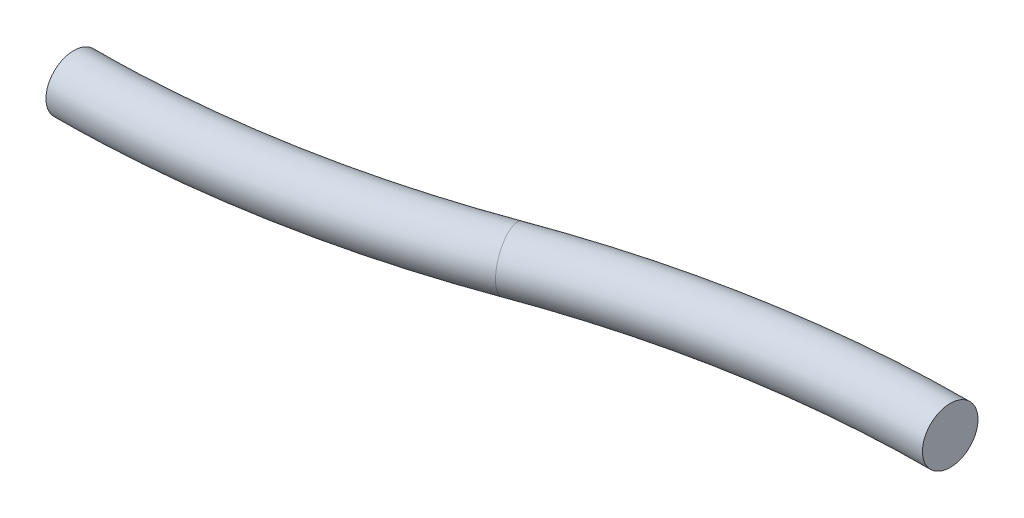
ISO-10303-21;
HEADER;
FILE_DESCRIPTION(('STEP AP214'),'2;1');
FILE_NAME('part.step','',(''),(''),'','','');
FILE_SCHEMA(('AUTOMOTIVE_DESIGN { 1 0 10303 214 1 1 1 1 }'));
ENDSEC;
DATA;
#1=APPLICATION_CONTEXT('core data for automotive mechanical design processes');
#2=APPLICATION_PROTOCOL_DEFINITION('international standard','automotive_design',2000,#1);
#3=PRODUCT_CONTEXT('',#1,'mechanical');
#4=PRODUCT('Part','Part','',(#3));
#5=PRODUCT_RELATED_PRODUCT_CATEGORY('part','',(#4));
#6=PRODUCT_DEFINITION_FORMATION('','',#4);
#7=PRODUCT_DEFINITION_CONTEXT('part definition',#1,'design');
#8=PRODUCT_DEFINITION('design','',#6,#7);
#9=PRODUCT_DEFINITION_SHAPE('','',#8);
#10=(LENGTH_UNIT() NAMED_UNIT(*) SI_UNIT(.MILLI.,.METRE.));
#11=(NAMED_UNIT(*) PLANE_ANGLE_UNIT() SI_UNIT($,.RADIAN.));
#12=(NAMED_UNIT(*) SI_UNIT($,.STERADIAN.) SOLID_ANGLE_UNIT());
#13=UNCERTAINTY_MEASURE_WITH_UNIT(LENGTH_MEASURE(1.E-05),#10,'distance_accuracy_value','');
#14=(GEOMETRIC_REPRESENTATION_CONTEXT(3) GLOBAL_UNCERTAINTY_ASSIGNED_CONTEXT((#13)) GLOBAL_UNIT_ASSIGNED_CONTEXT((#10,
#11,#12)) REPRESENTATION_CONTEXT('',''));
#15=CARTESIAN_POINT('',(0.,0.,0.));
#16=DIRECTION('',(0.,0.,1.));
#17=DIRECTION('',(1.,0.,0.));
#18=AXIS2_PLACEMENT_3D('',#15,#16,#17);
#19=CARTESIAN_POINT('',(127.508,0.,161.637028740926));
#20=DIRECTION('',(0.,-1.,0.));
#21=DIRECTION('',(0.,0.,-1.));
#22=AXIS2_PLACEMENT_3D('',#19,#20,#21);
#23=TOROIDAL_SURFACE('',#22,184.382728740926,4.7625);
#24=CARTESIAN_POINT('',(63.754,0.,-11.37285));
#25=DIRECTION('',(0.938319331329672,0.,-0.345769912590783));
#26=DIRECTION('',(-0.345769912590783,0.,-0.938319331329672));
#27=AXIS2_PLACEMENT_3D('',#24,#25,#26);
#28=CIRCLE('',#27,4.7625);
#29=CARTESIAN_POINT('',(62.1072707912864,0.,-15.8415958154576));
#30=VERTEX_POINT('',#29);
#31=EDGE_CURVE('E35',#30,#30,#28,.T.);
#32=CARTESIAN_POINT('',(127.508,0.,-22.7457000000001));
#33=DIRECTION('',(1.,0.,0.));
#34=DIRECTION('',(0.,0.,-1.));
#35=AXIS2_PLACEMENT_3D('',#32,#33,#34);
#36=CIRCLE('',#35,4.7625);
#37=CARTESIAN_POINT('',(127.508,0.,-27.5082000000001));
#38=VERTEX_POINT('',#37);
#39=EDGE_CURVE('E10',#38,#38,#36,.T.);
#40=CARTESIAN_POINT('',(127.508,0.,161.637028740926));
#41=DIRECTION('',(0.,-1.,0.));
#42=DIRECTION('',(0.,0.,-1.));
#43=AXIS2_PLACEMENT_3D('',#40,#41,#42);
#44=CIRCLE('',#43,189.145228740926);
#45=EDGE_CURVE('',#30,#38,#44,.T.);
#46=ORIENTED_EDGE('',*,*,#31,.T.);
#47=ORIENTED_EDGE('',*,*,#39,.F.);
#48=ORIENTED_EDGE('',*,*,#45,.T.);
#49=ORIENTED_EDGE('',*,*,#45,.F.);
#50=EDGE_LOOP('',(#46,#48,#47,#49));
#51=FACE_BOUND('',#50,.T.);
#52=ADVANCED_FACE('F29',(#51),#23,.T.);
#53=CARTESIAN_POINT('',(0.,0.,-184.382728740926));
#54=DIRECTION('',(0.,-1.,0.));
#55=DIRECTION('',(0.,0.,-1.));
#56=AXIS2_PLACEMENT_3D('',#53,#54,#55);
#57=TOROIDAL_SURFACE('',#56,184.382728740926,4.7625);
#58=ORIENTED_EDGE('',*,*,#31,.F.);
#59=EDGE_LOOP('',(#58));
#60=FACE_BOUND('',#59,.T.);
#61=CARTESIAN_POINT('',(0.,0.,0.));
#62=DIRECTION('',(1.,0.,0.));
#63=DIRECTION('',(0.,0.,-1.));
#64=AXIS2_PLACEMENT_3D('',#61,#62,#63);
#65=CIRCLE('',#64,4.7625);
#66=CARTESIAN_POINT('',(0.,0.,-4.7625));
#67=VERTEX_POINT('',#66);
#68=EDGE_CURVE('E39',#67,#67,#65,.T.);
#69=ORIENTED_EDGE('',*,*,#68,.T.);
#70=EDGE_LOOP('',(#69));
#71=FACE_BOUND('',#70,.T.);
#72=ADVANCED_FACE('F46',(#60,#71),#57,.T.);
#73=CARTESIAN_POINT('',(127.508,0.,-22.7457000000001));
#74=DIRECTION('',(1.,0.,0.));
#75=DIRECTION('',(0.,0.,-1.));
#76=AXIS2_PLACEMENT_3D('',#73,#74,#75);
#77=PLANE('',#76);
#78=ORIENTED_EDGE('',*,*,#39,.T.);
#79=EDGE_LOOP('',(#78));
#80=FACE_BOUND('',#79,.T.);
#81=ADVANCED_FACE('F50',(#80),#77,.T.);
#82=CARTESIAN_POINT('',(0.,0.,0.));
#83=DIRECTION('',(1.,0.,0.));
#84=DIRECTION('',(0.,0.,-1.));
#85=AXIS2_PLACEMENT_3D('',#82,#83,#84);
#86=PLANE('',#85);
#87=ORIENTED_EDGE('',*,*,#68,.F.);
#88=EDGE_LOOP('',(#87));
#89=FACE_BOUND('',#88,.T.);
#90=ADVANCED_FACE('F48',(#89),#86,.F.);
#91=CLOSED_SHELL('',(#52,#72,#81,#90));
#92=MANIFOLD_SOLID_BREP('B2',#91);
#93=ADVANCED_BREP_SHAPE_REPRESENTATION('',(#18,#92),#14);
#94=SHAPE_DEFINITION_REPRESENTATION(#9,#93);
ENDSEC;
END-ISO-10303-21;
